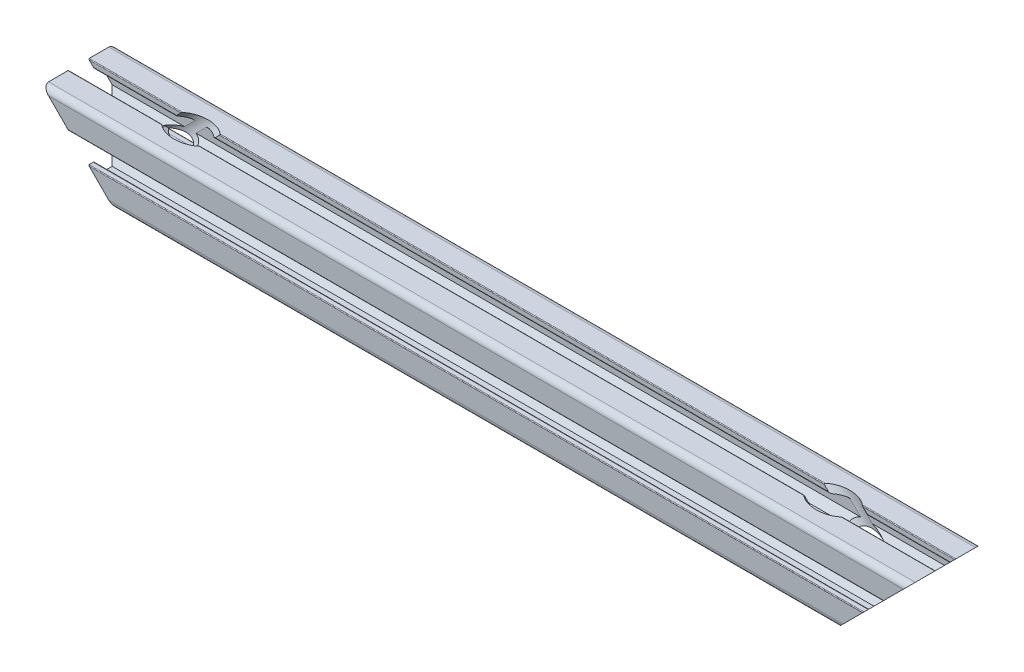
from build123d import *

# Parameters (mm, degrees)
MODEL_R                                 = 3.1
F_30_SARJA_1_0005_30X30_1_DEPTH         = 360
CUT_EXTRUDE1_DEPTH                      = 213.661703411
CBORE_FOR_M8_HEX_HEAD_BOLT1_D           = 8.5
CBORE_FOR_M8_HEX_HEAD_BOLT1_CBORE_D     = 14
CBORE_FOR_M8_HEX_HEAD_BOLT1_CBORE_DEPTH = 25


with BuildPart() as part:
    # Model → 30-sarja 1.0005 30X30_1 (new body)
    with BuildSketch(Plane.ZY.offset(-150)):
        with BuildLine():
            Line((-15.000001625, 12.5), (-15.000001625, 4.400000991))
            ThreePointArc((-15.000001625, 4.400000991), (-14.912132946, 4.187870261), (-14.700001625, 4.100003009))
            Line((-14.700001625, 4.100003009), (-13.000001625, 4.100003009))
            ThreePointArc((-13.000001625, 4.100003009), (-12.646448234, 4.246449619), (-12.500001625, 4.600003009))
            Line((-12.500001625, 4.600003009), (-12.500001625, 6.500007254))
            ThreePointArc((-12.500001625, 6.500007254), (-12.412132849, 6.712137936), (-12.200001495, 6.80000509))
            Line((-12.200001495, 6.80000509), (-7.86000148, 6.80000509))
            Line((-7.86000148, 6.80000509), (-5.00000148, 3.940005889))
            Line((-5.00000148, 3.940005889), (-5.00000148, -3.939994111))
            Line((-5.00000148, -3.939994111), (-7.860001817, -6.799994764))
            Line((-7.860001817, -6.799994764), (-12.20000161, -6.799994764))
            ThreePointArc((-12.20000161, -6.799994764), (-12.412133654, -6.712126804), (-12.500001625, -6.499994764))
            Line((-12.500001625, -6.499994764), (-12.500001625, -4.599996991))
            ThreePointArc((-12.500001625, -4.599996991), (-12.646448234, -4.2464436), (-13.000001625, -4.099996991))
            Line((-13.000001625, -4.099996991), (-14.700001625, -4.099996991))
            ThreePointArc((-14.700001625, -4.099996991), (-14.912133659, -4.187864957), (-15.000001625, -4.399996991))
            Line((-15.000001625, -4.399996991), (-15.000001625, -12.5))
            ThreePointArc((-15.000001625, -12.5), (-14.267768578, -14.267766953), (-12.500001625, -15))
            Line((-12.500001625, -15), (-4.399999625, -15))
            ThreePointArc((-4.399999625, -15), (-4.187867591, -14.912132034), (-4.099999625, -14.7))
            Line((-4.099999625, -14.7), (-4.099999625, -13.000000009))
            ThreePointArc((-4.099999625, -13.000000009), (-4.246446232, -12.646446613), (-4.599999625, -12.500000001))
            Line((-4.599999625, -12.500000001), (-6.499996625, -12.500000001))
            ThreePointArc((-6.499996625, -12.500000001), (-6.712128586, -12.412132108), (-6.799996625, -12.200000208))
            Line((-6.799996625, -12.200000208), (-6.799996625, -7.860000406))
            Line((-6.799996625, -7.860000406), (-3.939994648, -5.000001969))
            Line((-3.939994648, -5.000001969), (3.940005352, -5.000001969))
            Line((3.940005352, -5.000001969), (6.800005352, -7.860001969))
            Line((6.800005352, -7.860001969), (6.800005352, -12.20000177))
            ThreePointArc((6.800005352, -12.20000177), (6.712136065, -12.412133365), (6.500003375, -12.500000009))
            Line((6.500003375, -12.500000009), (4.600000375, -12.500000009))
            ThreePointArc((4.600000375, -12.500000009), (4.246446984, -12.646446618), (4.100000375, -13.000000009))
            Line((4.100000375, -13.000000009), (4.100000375, -14.7))
            ThreePointArc((4.100000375, -14.7), (4.18786834, -14.912132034), (4.400000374, -15))
            Line((4.400000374, -15), (12.499998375, -15))
            ThreePointArc((12.499998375, -15), (14.267765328, -14.267766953), (14.999998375, -12.5))
            Line((14.999998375, -12.5), (14.999998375, -4.399996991))
            ThreePointArc((14.999998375, -4.399996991), (14.912130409, -4.187864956), (14.699998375, -4.099996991))
            Line((14.699998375, -4.099996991), (12.999998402, -4.099996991))
            ThreePointArc((12.999998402, -4.099996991), (12.64644502, -4.246443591), (12.499998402, -4.599996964))
            Line((12.499998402, -4.599996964), (12.499998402, -6.499993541))
            ThreePointArc((12.499998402, -6.499993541), (12.412130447, -6.712125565), (12.199998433, -6.799993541))
            Line((12.199998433, -6.799993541), (7.859998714, -6.799993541))
            Line((7.859998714, -6.799993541), (4.999998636, -3.939993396))
            Line((4.999998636, -3.939993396), (4.999998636, 3.940006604))
            Line((4.999998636, 3.940006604), (7.859998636, 6.800006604))
            Line((7.859998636, 6.800006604), (12.199999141, 6.800006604))
            ThreePointArc((12.199999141, 6.800006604), (12.412131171, 6.712138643), (12.499999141, 6.500006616))
            Line((12.499999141, 6.500006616), (12.499999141, 4.60000106))
            ThreePointArc((12.499999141, 4.60000106), (12.646446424, 4.246448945), (12.999999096, 4.100003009))
            Line((12.999999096, 4.100003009), (14.699998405, 4.100003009))
            ThreePointArc((14.699998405, 4.100003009), (14.912128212, 4.18786657), (15, 4.399992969))
            Line((15, 4.399992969), (15, 12.499992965))
            ThreePointArc((15, 12.499992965), (14.267768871, 14.267765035), (12.499998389, 15))
            Line((12.499998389, 15), (4.399997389, 15))
            ThreePointArc((4.399997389, 15), (4.187867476, 14.912132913), (4.10000039, 14.700003))
            Line((4.10000039, 14.700003), (4.10000039, 13))
            ThreePointArc((4.10000039, 13), (4.246447, 12.646446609), (4.600000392, 12.5))
            Line((4.600000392, 12.5), (6.500004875, 12.5))
            ThreePointArc((6.500004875, 12.5), (6.712136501, 12.412133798), (6.800005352, 12.20000327))
            Line((6.800005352, 12.20000327), (6.800005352, 7.860001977))
            Line((6.800005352, 7.860001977), (3.940005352, 5.000001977))
            Line((3.940005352, 5.000001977), (-3.939994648, 5.000001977))
            Line((-3.939994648, 5.000001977), (-6.799996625, 7.86))
            Line((-6.799996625, 7.86), (-6.799996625, 12.200000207))
            ThreePointArc((-6.799996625, 12.200000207), (-6.712128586, 12.412132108), (-6.499996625, 12.5))
            Line((-6.499996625, 12.5), (-4.59999961, 12.5))
            ThreePointArc((-4.59999961, 12.5), (-4.24644622, 12.646446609), (-4.09999961, 13))
            Line((-4.09999961, 13), (-4.09999961, 14.7))
            ThreePointArc((-4.09999961, 14.7), (-4.187867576, 14.912132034), (-4.39999961, 15))
            Line((-4.39999961, 15), (-12.500001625, 15))
            ThreePointArc((-12.500001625, 15), (-14.267768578, 14.267766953), (-15.000001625, 12.5))
        make_face()
        with Locations((10.899998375, -10.900007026)):
            Circle(MODEL_R, mode=Mode.SUBTRACT)
        with Locations((-10.900001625, 10.899992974)):
            Circle(MODEL_R, mode=Mode.SUBTRACT)
        with Locations((10.899998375, 10.899992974)):
            Circle(MODEL_R, mode=Mode.SUBTRACT)
        with Locations((-10.900001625, -10.900007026)):
            Circle(MODEL_R, mode=Mode.SUBTRACT)
        with BuildLine():
            Line((-3.363291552, -1.949072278), (-3.641600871, -2.227381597))
            Line((-3.641600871, -2.227381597), (-3.864716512, -3.277058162))
            ThreePointArc((-3.864716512, -3.277058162), (-3.725327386, -3.73020201), (-3.270287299, -3.863270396))
            Line((-3.270287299, -3.863270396), (-2.227387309, -3.641595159))
            Line((-2.227387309, -3.641595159), (-1.949077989, -3.36328584))
            ThreePointArc((-1.949077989, -3.36328584), (-1.786691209, -3.279570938), (-1.605855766, -3.305574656))
            ThreePointArc((-1.605855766, -3.305574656), (0.105806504, -3.67347268), (1.793455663, -3.207664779))
            Line((1.793455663, -3.207664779), (2.227386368, -3.641595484))
            Line((2.227386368, -3.641595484), (3.270286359, -3.86327072))
            ThreePointArc((3.270286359, -3.86327072), (3.725326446, -3.730202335), (3.864715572, -3.277058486))
            Line((3.864715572, -3.277058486), (3.641599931, -2.227381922))
            Line((3.641599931, -2.227381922), (3.363289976, -1.949071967))
            ThreePointArc((3.363289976, -1.949071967), (3.27957663, -1.78668527), (3.305581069, -1.605850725))
            ThreePointArc((3.305581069, -1.605850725), (3.674999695, 4.86e-06), (3.305576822, 1.605859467))
            ThreePointArc((3.305576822, 1.605859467), (3.279574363, 1.78669396), (3.363289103, 1.949079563))
            Line((3.363289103, 1.949079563), (3.641598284, 2.227388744))
            Line((3.641598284, 2.227388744), (3.864713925, 3.277065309))
            ThreePointArc((3.864713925, 3.277065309), (3.699829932, 3.761679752), (3.195145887, 3.847306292))
            Line((3.195145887, 3.847306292), (2.227384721, 3.641602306))
            Line((2.227384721, 3.641602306), (1.949075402, 3.363292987))
            ThreePointArc((1.949075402, 3.363292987), (1.786688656, 3.279578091), (1.60585324, 3.305581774))
            ThreePointArc((1.60585324, 3.305581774), (6.78e-07, 3.675001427), (-1.605852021, 3.305582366))
            ThreePointArc((-1.605852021, 3.305582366), (-1.786687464, 3.279578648), (-1.949074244, 3.36329355))
            Line((-1.949074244, 3.36329355), (-2.227383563, 3.641602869))
            Line((-2.227383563, 3.641602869), (-3.270283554, 3.863278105))
            ThreePointArc((-3.270283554, 3.863278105), (-3.725323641, 3.730209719), (-3.864712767, 3.277065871))
            Line((-3.864712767, 3.277065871), (-3.641597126, 2.227389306))
            Line((-3.641597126, 2.227389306), (-3.363287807, 1.949079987))
            ThreePointArc((-3.363287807, 1.949079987), (-3.279572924, 1.786693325), (-3.305576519, 1.605857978))
            ThreePointArc((-3.305576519, 1.605857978), (-3.674998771, 4.405e-06), (-3.305580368, -1.605850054))
            ThreePointArc((-3.305580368, -1.605850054), (-3.27957665, -1.786685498), (-3.363291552, -1.949072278))
        make_face(mode=Mode.SUBTRACT)
    extrude(amount=F_30_SARJA_1_0005_30X30_1_DEPTH)

    # Sketch2 → Cut-Extrude1 (cut, through all)
    with BuildSketch(Plane.XY.offset(15)):
        Polygon((150, 15), (180, -15), (227.252385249, -15), (227.252385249, 15), align=None)
        Polygon((-227.252385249, 15), (-227.252385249, -15), (-180, -15), (-210, 15), align=None)
    cut_extrude1 = extrude(amount=-CUT_EXTRUDE1_DEPTH, mode=Mode.SUBTRACT)

    # Mirror4: Cut-Extrude1 across plane
    add(cut_extrude1.mirror(Plane(origin=(-30, 0, 0), x_dir=(0, 0, 1), z_dir=(1, 0, 0))), mode=Mode.SUBTRACT)

    # CBORE for M8 Hex Head Bolt1 (through all)
    with Locations(Plane(origin=(39.215728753, -39.215728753, 0), x_dir=(0, 0, -1), z_dir=(-0.7071067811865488, 0.7071067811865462, 0))):
        with Locations((1.625e-06, -83.672618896)):
            cbore_for_m8_hex_head_bolt1 = CounterBoreHole(CBORE_FOR_M8_HEX_HEAD_BOLT1_D / 2, CBORE_FOR_M8_HEX_HEAD_BOLT1_CBORE_D / 2, CBORE_FOR_M8_HEX_HEAD_BOLT1_CBORE_DEPTH)

    # Mirror5: CBORE for M8 Hex Head Bolt1 across plane
    add(cbore_for_m8_hex_head_bolt1.mirror(Plane(origin=(-30, 0, 0), x_dir=(0, 0, 1), z_dir=(1, 0, 0))), mode=Mode.SUBTRACT)


solid = part.part
